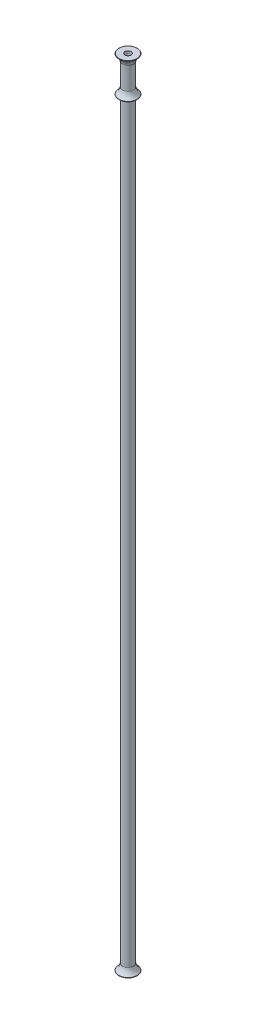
ISO-10303-21;
HEADER;
FILE_DESCRIPTION(('STEP AP214'),'2;1');
FILE_NAME('part.step','',(''),(''),'','','');
FILE_SCHEMA(('AUTOMOTIVE_DESIGN { 1 0 10303 214 1 1 1 1 }'));
ENDSEC;
DATA;
#1=APPLICATION_CONTEXT('core data for automotive mechanical design processes');
#2=APPLICATION_PROTOCOL_DEFINITION('international standard','automotive_design',2000,#1);
#3=PRODUCT_CONTEXT('',#1,'mechanical');
#4=PRODUCT('Part','Part','',(#3));
#5=PRODUCT_RELATED_PRODUCT_CATEGORY('part','',(#4));
#6=PRODUCT_DEFINITION_FORMATION('','',#4);
#7=PRODUCT_DEFINITION_CONTEXT('part definition',#1,'design');
#8=PRODUCT_DEFINITION('design','',#6,#7);
#9=PRODUCT_DEFINITION_SHAPE('','',#8);
#10=(LENGTH_UNIT() NAMED_UNIT(*) SI_UNIT(.MILLI.,.METRE.));
#11=(NAMED_UNIT(*) PLANE_ANGLE_UNIT() SI_UNIT($,.RADIAN.));
#12=(NAMED_UNIT(*) SI_UNIT($,.STERADIAN.) SOLID_ANGLE_UNIT());
#13=UNCERTAINTY_MEASURE_WITH_UNIT(LENGTH_MEASURE(1.E-05),#10,'distance_accuracy_value','');
#14=(GEOMETRIC_REPRESENTATION_CONTEXT(3) GLOBAL_UNCERTAINTY_ASSIGNED_CONTEXT((#13)) GLOBAL_UNIT_ASSIGNED_CONTEXT((#10,
#11,#12)) REPRESENTATION_CONTEXT('',''));
#15=CARTESIAN_POINT('',(0.,0.,0.));
#16=DIRECTION('',(0.,0.,1.));
#17=DIRECTION('',(1.,0.,0.));
#18=AXIS2_PLACEMENT_3D('',#15,#16,#17);
#19=CARTESIAN_POINT('',(0.,0.,0.));
#20=DIRECTION('',(0.,-1.,0.));
#21=DIRECTION('',(0.,0.,-1.));
#22=AXIS2_PLACEMENT_3D('',#19,#20,#21);
#23=CYLINDRICAL_SURFACE('',#22,6.);
#24=CARTESIAN_POINT('',(0.,0.,0.));
#25=DIRECTION('',(0.,-1.,0.));
#26=DIRECTION('',(0.,0.,-1.));
#27=AXIS2_PLACEMENT_3D('',#24,#25,#26);
#28=CIRCLE('',#27,6.);
#29=CARTESIAN_POINT('',(0.,0.,-6.));
#30=VERTEX_POINT('',#29);
#31=EDGE_CURVE('E77',#30,#30,#28,.T.);
#32=ORIENTED_EDGE('',*,*,#31,.T.);
#33=EDGE_LOOP('',(#32));
#34=FACE_BOUND('',#33,.T.);
#35=CARTESIAN_POINT('',(0.,1560.,0.));
#36=DIRECTION('',(0.,-1.,0.));
#37=DIRECTION('',(0.,0.,-1.));
#38=AXIS2_PLACEMENT_3D('',#35,#36,#37);
#39=CIRCLE('',#38,6.);
#40=CARTESIAN_POINT('',(0.,1560.,-6.));
#41=VERTEX_POINT('',#40);
#42=EDGE_CURVE('E10',#41,#41,#39,.T.);
#43=ORIENTED_EDGE('',*,*,#42,.F.);
#44=EDGE_LOOP('',(#43));
#45=FACE_BOUND('',#44,.T.);
#46=ADVANCED_FACE('F37',(#34,#45),#23,.F.);
#47=CARTESIAN_POINT('',(6.,1560.,0.));
#48=DIRECTION('',(0.,1.,0.));
#49=DIRECTION('',(0.,0.,1.));
#50=AXIS2_PLACEMENT_3D('',#47,#48,#49);
#51=PLANE('',#50);
#52=ORIENTED_EDGE('',*,*,#42,.T.);
#53=EDGE_LOOP('',(#52));
#54=FACE_BOUND('',#53,.T.);
#55=CARTESIAN_POINT('',(0.,1560.,0.));
#56=DIRECTION('',(0.,-1.,0.));
#57=DIRECTION('',(0.,0.,-1.));
#58=AXIS2_PLACEMENT_3D('',#55,#56,#57);
#59=CIRCLE('',#58,17.5);
#60=CARTESIAN_POINT('',(0.,1560.,-17.5));
#61=VERTEX_POINT('',#60);
#62=EDGE_CURVE('E43',#61,#61,#59,.T.);
#63=ORIENTED_EDGE('',*,*,#62,.F.);
#64=EDGE_LOOP('',(#63));
#65=FACE_BOUND('',#64,.T.);
#66=ADVANCED_FACE('F95',(#54,#65),#51,.T.);
#67=CARTESIAN_POINT('',(0.,1559.5,0.));
#68=DIRECTION('',(0.,-1.,0.));
#69=DIRECTION('',(0.,0.,-1.));
#70=AXIS2_PLACEMENT_3D('',#67,#68,#69);
#71=TOROIDAL_SURFACE('',#70,17.5,0.499999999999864);
#72=ORIENTED_EDGE('',*,*,#62,.T.);
#73=EDGE_LOOP('',(#72));
#74=FACE_BOUND('',#73,.T.);
#75=CARTESIAN_POINT('',(0.,1559.11263485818,0.));
#76=DIRECTION('',(0.,-1.,0.));
#77=DIRECTION('',(0.,0.,-1.));
#78=AXIS2_PLACEMENT_3D('',#75,#76,#77);
#79=CIRCLE('',#78,17.8161459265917);
#80=CARTESIAN_POINT('',(0.,1559.11263485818,-17.8161459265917));
#81=VERTEX_POINT('',#80);
#82=EDGE_CURVE('E47',#81,#81,#79,.T.);
#83=ORIENTED_EDGE('',*,*,#82,.F.);
#84=EDGE_LOOP('',(#83));
#85=FACE_BOUND('',#84,.T.);
#86=ADVANCED_FACE('F99',(#74,#85),#71,.T.);
#87=CARTESIAN_POINT('',(0.,1543.61802918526,0.));
#88=DIRECTION('',(0.,-1.,0.));
#89=DIRECTION('',(0.,0.,-1.));
#90=AXIS2_PLACEMENT_3D('',#87,#88,#89);
#91=TOROIDAL_SURFACE('',#90,30.4619829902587,20.);
#92=ORIENTED_EDGE('',*,*,#82,.T.);
#93=EDGE_LOOP('',(#92));
#94=FACE_BOUND('',#93,.T.);
#95=CARTESIAN_POINT('',(0.,1547.,0.));
#96=DIRECTION('',(0.,-1.,0.));
#97=DIRECTION('',(0.,0.,-1.));
#98=AXIS2_PLACEMENT_3D('',#95,#96,#97);
#99=CIRCLE('',#98,10.75);
#100=CARTESIAN_POINT('',(0.,1547.,-10.75));
#101=VERTEX_POINT('',#100);
#102=EDGE_CURVE('E51',#101,#101,#99,.T.);
#103=ORIENTED_EDGE('',*,*,#102,.F.);
#104=EDGE_LOOP('',(#103));
#105=FACE_BOUND('',#104,.T.);
#106=ADVANCED_FACE('F103',(#94,#105),#91,.F.);
#107=CARTESIAN_POINT('',(0.,0.,0.));
#108=DIRECTION('',(0.,-1.,0.));
#109=DIRECTION('',(0.,0.,-1.));
#110=AXIS2_PLACEMENT_3D('',#107,#108,#109);
#111=CYLINDRICAL_SURFACE('',#110,10.75);
#112=ORIENTED_EDGE('',*,*,#102,.T.);
#113=EDGE_LOOP('',(#112));
#114=FACE_BOUND('',#113,.T.);
#115=CARTESIAN_POINT('',(0.,1503.,0.));
#116=DIRECTION('',(0.,-1.,0.));
#117=DIRECTION('',(0.,0.,-1.));
#118=AXIS2_PLACEMENT_3D('',#115,#116,#117);
#119=CIRCLE('',#118,10.7499999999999);
#120=CARTESIAN_POINT('',(0.,1503.,-10.7499999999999));
#121=VERTEX_POINT('',#120);
#122=EDGE_CURVE('E56',#121,#121,#119,.T.);
#123=ORIENTED_EDGE('',*,*,#122,.F.);
#124=EDGE_LOOP('',(#123));
#125=FACE_BOUND('',#124,.T.);
#126=ADVANCED_FACE('F109',(#114,#125),#111,.T.);
#127=CARTESIAN_POINT('',(0.,1506.38197081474,0.));
#128=DIRECTION('',(0.,-1.,0.));
#129=DIRECTION('',(0.,0.,-1.));
#130=AXIS2_PLACEMENT_3D('',#127,#128,#129);
#131=TOROIDAL_SURFACE('',#130,30.4619829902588,20.);
#132=ORIENTED_EDGE('',*,*,#122,.T.);
#133=EDGE_LOOP('',(#132));
#134=FACE_BOUND('',#133,.T.);
#135=CARTESIAN_POINT('',(0.,1490.88736514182,0.));
#136=DIRECTION('',(0.,-1.,0.));
#137=DIRECTION('',(0.,0.,-1.));
#138=AXIS2_PLACEMENT_3D('',#135,#136,#137);
#139=CIRCLE('',#138,17.8161459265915);
#140=CARTESIAN_POINT('',(0.,1490.88736514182,-17.8161459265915));
#141=VERTEX_POINT('',#140);
#142=EDGE_CURVE('E59',#141,#141,#139,.T.);
#143=ORIENTED_EDGE('',*,*,#142,.F.);
#144=EDGE_LOOP('',(#143));
#145=FACE_BOUND('',#144,.T.);
#146=ADVANCED_FACE('F113',(#134,#145),#131,.F.);
#147=CARTESIAN_POINT('',(0.,1490.5,0.));
#148=DIRECTION('',(0.,-1.,0.));
#149=DIRECTION('',(0.,0.,-1.));
#150=AXIS2_PLACEMENT_3D('',#147,#148,#149);
#151=TOROIDAL_SURFACE('',#150,17.5,0.499999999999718);
#152=ORIENTED_EDGE('',*,*,#142,.T.);
#153=EDGE_LOOP('',(#152));
#154=FACE_BOUND('',#153,.T.);
#155=CARTESIAN_POINT('',(0.,1490.,0.));
#156=DIRECTION('',(0.,-1.,0.));
#157=DIRECTION('',(0.,0.,-1.));
#158=AXIS2_PLACEMENT_3D('',#155,#156,#157);
#159=CIRCLE('',#158,17.5);
#160=CARTESIAN_POINT('',(0.,1490.,-17.5));
#161=VERTEX_POINT('',#160);
#162=EDGE_CURVE('E62',#161,#161,#159,.T.);
#163=ORIENTED_EDGE('',*,*,#162,.F.);
#164=EDGE_LOOP('',(#163));
#165=FACE_BOUND('',#164,.T.);
#166=ADVANCED_FACE('F117',(#154,#165),#151,.T.);
#167=CARTESIAN_POINT('',(10.7500000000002,1490.,0.));
#168=DIRECTION('',(0.,-1.,0.));
#169=DIRECTION('',(0.,0.,-1.));
#170=AXIS2_PLACEMENT_3D('',#167,#168,#169);
#171=PLANE('',#170);
#172=ORIENTED_EDGE('',*,*,#162,.T.);
#173=EDGE_LOOP('',(#172));
#174=FACE_BOUND('',#173,.T.);
#175=CARTESIAN_POINT('',(0.,1490.,0.));
#176=DIRECTION('',(0.,-1.,0.));
#177=DIRECTION('',(0.,0.,-1.));
#178=AXIS2_PLACEMENT_3D('',#175,#176,#177);
#179=CIRCLE('',#178,10.7500000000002);
#180=CARTESIAN_POINT('',(0.,1490.,-10.7500000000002));
#181=VERTEX_POINT('',#180);
#182=EDGE_CURVE('E65',#181,#181,#179,.T.);
#183=ORIENTED_EDGE('',*,*,#182,.F.);
#184=EDGE_LOOP('',(#183));
#185=FACE_BOUND('',#184,.T.);
#186=ADVANCED_FACE('F121',(#174,#185),#171,.T.);
#187=CARTESIAN_POINT('',(0.,0.,0.));
#188=DIRECTION('',(0.,-1.,0.));
#189=DIRECTION('',(0.,0.,-1.));
#190=AXIS2_PLACEMENT_3D('',#187,#188,#189);
#191=CYLINDRICAL_SURFACE('',#190,10.7500000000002);
#192=ORIENTED_EDGE('',*,*,#182,.T.);
#193=EDGE_LOOP('',(#192));
#194=FACE_BOUND('',#193,.T.);
#195=CARTESIAN_POINT('',(0.,13.,0.));
#196=DIRECTION('',(0.,-1.,0.));
#197=DIRECTION('',(0.,0.,-1.));
#198=AXIS2_PLACEMENT_3D('',#195,#196,#197);
#199=CIRCLE('',#198,10.7500000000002);
#200=CARTESIAN_POINT('',(0.,13.,-10.7500000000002));
#201=VERTEX_POINT('',#200);
#202=EDGE_CURVE('E68',#201,#201,#199,.T.);
#203=ORIENTED_EDGE('',*,*,#202,.F.);
#204=EDGE_LOOP('',(#203));
#205=FACE_BOUND('',#204,.T.);
#206=ADVANCED_FACE('F125',(#194,#205),#191,.T.);
#207=CARTESIAN_POINT('',(0.,16.3819708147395,0.));
#208=DIRECTION('',(0.,-1.,0.));
#209=DIRECTION('',(0.,0.,-1.));
#210=AXIS2_PLACEMENT_3D('',#207,#208,#209);
#211=TOROIDAL_SURFACE('',#210,30.4619829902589,20.);
#212=ORIENTED_EDGE('',*,*,#202,.T.);
#213=EDGE_LOOP('',(#212));
#214=FACE_BOUND('',#213,.T.);
#215=CARTESIAN_POINT('',(0.,0.887365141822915,0.));
#216=DIRECTION('',(0.,-1.,0.));
#217=DIRECTION('',(0.,0.,-1.));
#218=AXIS2_PLACEMENT_3D('',#215,#216,#217);
#219=CIRCLE('',#218,17.8161459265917);
#220=CARTESIAN_POINT('',(0.,0.887365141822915,-17.8161459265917));
#221=VERTEX_POINT('',#220);
#222=EDGE_CURVE('E71',#221,#221,#219,.T.);
#223=ORIENTED_EDGE('',*,*,#222,.F.);
#224=EDGE_LOOP('',(#223));
#225=FACE_BOUND('',#224,.T.);
#226=ADVANCED_FACE('F91',(#214,#225),#211,.F.);
#227=CARTESIAN_POINT('',(0.,0.5,0.));
#228=DIRECTION('',(0.,-1.,0.));
#229=DIRECTION('',(0.,0.,-1.));
#230=AXIS2_PLACEMENT_3D('',#227,#228,#229);
#231=TOROIDAL_SURFACE('',#230,17.5,0.5);
#232=ORIENTED_EDGE('',*,*,#222,.T.);
#233=EDGE_LOOP('',(#232));
#234=FACE_BOUND('',#233,.T.);
#235=CARTESIAN_POINT('',(0.,0.,0.));
#236=DIRECTION('',(0.,-1.,0.));
#237=DIRECTION('',(0.,0.,-1.));
#238=AXIS2_PLACEMENT_3D('',#235,#236,#237);
#239=CIRCLE('',#238,17.5);
#240=CARTESIAN_POINT('',(0.,0.,-17.5));
#241=VERTEX_POINT('',#240);
#242=EDGE_CURVE('E74',#241,#241,#239,.T.);
#243=ORIENTED_EDGE('',*,*,#242,.F.);
#244=EDGE_LOOP('',(#243));
#245=FACE_BOUND('',#244,.T.);
#246=ADVANCED_FACE('F85',(#234,#245),#231,.T.);
#247=CARTESIAN_POINT('',(6.,0.,0.));
#248=DIRECTION('',(0.,-1.,0.));
#249=DIRECTION('',(0.,0.,-1.));
#250=AXIS2_PLACEMENT_3D('',#247,#248,#249);
#251=PLANE('',#250);
#252=ORIENTED_EDGE('',*,*,#242,.T.);
#253=EDGE_LOOP('',(#252));
#254=FACE_BOUND('',#253,.T.);
#255=ORIENTED_EDGE('',*,*,#31,.F.);
#256=EDGE_LOOP('',(#255));
#257=FACE_BOUND('',#256,.T.);
#258=ADVANCED_FACE('F83',(#254,#257),#251,.T.);
#259=CLOSED_SHELL('',(#46,#66,#86,#106,#126,#146,#166,#186,#206,#226,#246,#258));
#260=MANIFOLD_SOLID_BREP('B2',#259);
#261=ADVANCED_BREP_SHAPE_REPRESENTATION('',(#18,#260),#14);
#262=SHAPE_DEFINITION_REPRESENTATION(#9,#261);
ENDSEC;
END-ISO-10303-21;
